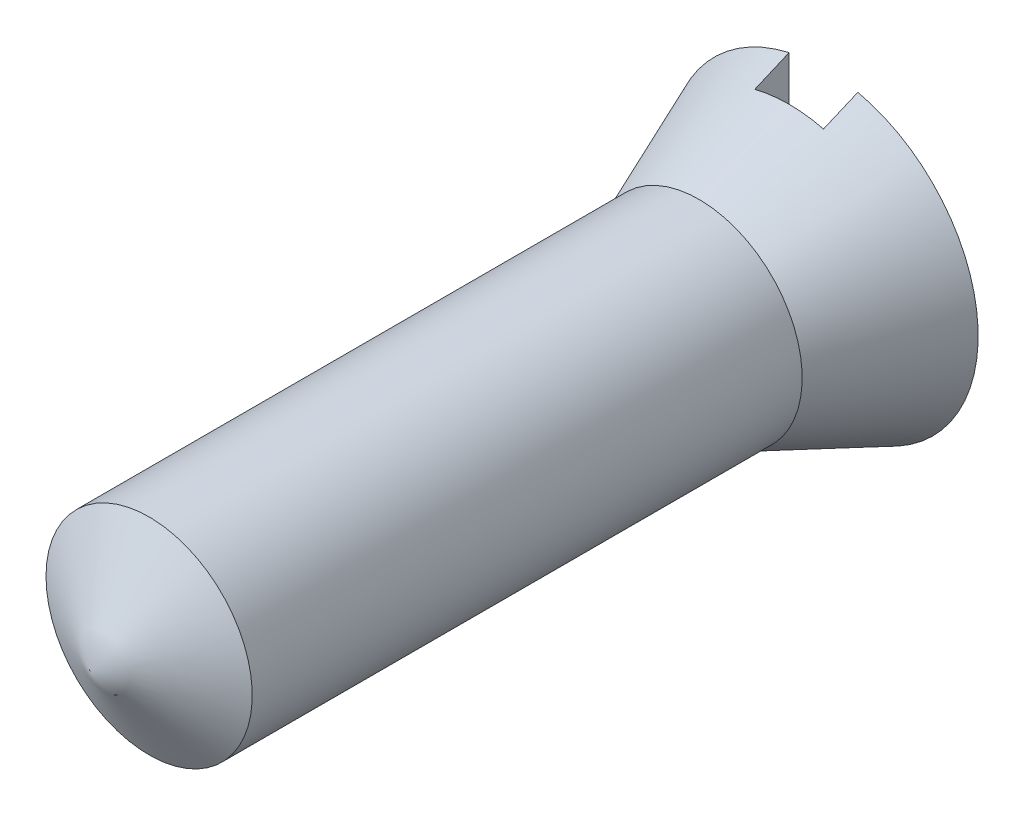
ISO-10303-21;
HEADER;
FILE_DESCRIPTION(('STEP AP214'),'2;1');
FILE_NAME('part.step','',(''),(''),'','','');
FILE_SCHEMA(('AUTOMOTIVE_DESIGN { 1 0 10303 214 1 1 1 1 }'));
ENDSEC;
DATA;
#1=APPLICATION_CONTEXT('core data for automotive mechanical design processes');
#2=APPLICATION_PROTOCOL_DEFINITION('international standard','automotive_design',2000,#1);
#3=PRODUCT_CONTEXT('',#1,'mechanical');
#4=PRODUCT('Part','Part','',(#3));
#5=PRODUCT_RELATED_PRODUCT_CATEGORY('part','',(#4));
#6=PRODUCT_DEFINITION_FORMATION('','',#4);
#7=PRODUCT_DEFINITION_CONTEXT('part definition',#1,'design');
#8=PRODUCT_DEFINITION('design','',#6,#7);
#9=PRODUCT_DEFINITION_SHAPE('','',#8);
#10=(LENGTH_UNIT() NAMED_UNIT(*) SI_UNIT(.MILLI.,.METRE.));
#11=(NAMED_UNIT(*) PLANE_ANGLE_UNIT() SI_UNIT($,.RADIAN.));
#12=(NAMED_UNIT(*) SI_UNIT($,.STERADIAN.) SOLID_ANGLE_UNIT());
#13=UNCERTAINTY_MEASURE_WITH_UNIT(LENGTH_MEASURE(1.E-05),#10,'distance_accuracy_value','');
#14=(GEOMETRIC_REPRESENTATION_CONTEXT(3) GLOBAL_UNCERTAINTY_ASSIGNED_CONTEXT((#13)) GLOBAL_UNIT_ASSIGNED_CONTEXT((#10,
#11,#12)) REPRESENTATION_CONTEXT('',''));
#15=CARTESIAN_POINT('',(0.,0.,0.));
#16=DIRECTION('',(0.,0.,1.));
#17=DIRECTION('',(1.,0.,0.));
#18=AXIS2_PLACEMENT_3D('',#15,#16,#17);
#19=CARTESIAN_POINT('',(0.,0.,-21.3520508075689));
#20=DIRECTION('',(0.,0.,1.));
#21=DIRECTION('',(1.,0.,0.));
#22=AXIS2_PLACEMENT_3D('',#19,#20,#21);
#23=PLANE('',#22);
#24=CARTESIAN_POINT('',(0.,0.,-21.3520508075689));
#25=DIRECTION('',(0.,0.,-1.));
#26=DIRECTION('',(-1.,0.,0.));
#27=AXIS2_PLACEMENT_3D('',#24,#25,#26);
#28=CIRCLE('',#27,4.5);
#29=CARTESIAN_POINT('',(-1.,-4.38748219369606,-21.3520508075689));
#30=VERTEX_POINT('',#29);
#31=CARTESIAN_POINT('',(-1.,4.38748219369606,-21.3520508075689));
#32=VERTEX_POINT('',#31);
#33=EDGE_CURVE('E92',#30,#32,#28,.T.);
#34=ORIENTED_EDGE('',*,*,#33,.T.);
#35=DIRECTION('',(0.,1.,0.));
#36=VECTOR('',#35,1.);
#37=CARTESIAN_POINT('',(-1.,-5.22642009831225,-21.3520508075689));
#38=LINE('',#37,#36);
#39=EDGE_CURVE('E81',#30,#32,#38,.T.);
#40=ORIENTED_EDGE('',*,*,#39,.F.);
#41=EDGE_LOOP('',(#34,#40));
#42=FACE_BOUND('',#41,.T.);
#43=ADVANCED_FACE('F32',(#42),#23,.F.);
#44=CARTESIAN_POINT('',(0.,0.,0.));
#45=DIRECTION('',(0.,0.,-1.));
#46=DIRECTION('',(-1.,0.,0.));
#47=AXIS2_PLACEMENT_3D('',#44,#45,#46);
#48=CONICAL_SURFACE('',#47,0.,1.0471975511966);
#49=CARTESIAN_POINT('',(0.,0.,-1.73205080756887));
#50=DIRECTION('',(0.,0.,-1.));
#51=DIRECTION('',(-1.,0.,0.));
#52=AXIS2_PLACEMENT_3D('',#49,#50,#51);
#53=CIRCLE('',#52,3.);
#54=CARTESIAN_POINT('',(-3.,0.,-1.73205080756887));
#55=VERTEX_POINT('',#54);
#56=EDGE_CURVE('E104',#55,#55,#53,.T.);
#57=ORIENTED_EDGE('',*,*,#56,.F.);
#58=EDGE_LOOP('',(#57));
#59=FACE_BOUND('',#58,.T.);
#60=CARTESIAN_POINT('',(0.,0.,0.));
#61=VERTEX_POINT('',#60);
#62=VERTEX_LOOP('',#61);
#63=FACE_BOUND('',#62,.T.);
#64=ADVANCED_FACE('F34',(#59,#63),#48,.T.);
#65=CARTESIAN_POINT('',(1.,4.38748219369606,-21.3520508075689));
#66=VERTEX_POINT('',#65);
#67=CARTESIAN_POINT('',(1.,-4.38748219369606,-21.3520508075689));
#68=VERTEX_POINT('',#67);
#69=EDGE_CURVE('E98',#66,#68,#28,.T.);
#70=ORIENTED_EDGE('',*,*,#69,.T.);
#71=DIRECTION('',(0.,-1.,0.));
#72=VECTOR('',#71,1.);
#73=CARTESIAN_POINT('',(1.,-5.22642009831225,-21.3520508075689));
#74=LINE('',#73,#72);
#75=EDGE_CURVE('E93',#66,#68,#74,.T.);
#76=ORIENTED_EDGE('',*,*,#75,.F.);
#77=EDGE_LOOP('',(#70,#76));
#78=FACE_BOUND('',#77,.T.);
#79=ADVANCED_FACE('F138',(#78),#23,.F.);
#80=CARTESIAN_POINT('',(0.,0.,-17.7320508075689));
#81=DIRECTION('',(0.,0.,-1.));
#82=DIRECTION('',(-1.,0.,0.));
#83=AXIS2_PLACEMENT_3D('',#80,#81,#82);
#84=CONICAL_SURFACE('',#83,3.,0.392828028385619);
#85=CARTESIAN_POINT('',(0.,0.,-20.3520508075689));
#86=DIRECTION('',(0.,0.,1.));
#87=DIRECTION('',(1.,0.,0.));
#88=AXIS2_PLACEMENT_3D('',#85,#86,#87);
#89=CIRCLE('',#88,4.08563535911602);
#90=CARTESIAN_POINT('',(1.,3.96136545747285,-20.3520508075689));
#91=VERTEX_POINT('',#90);
#92=CARTESIAN_POINT('',(-1.,3.96136545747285,-20.3520508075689));
#93=VERTEX_POINT('',#92);
#94=EDGE_CURVE('E87',#91,#93,#89,.T.);
#95=ORIENTED_EDGE('',*,*,#94,.T.);
#96=CARTESIAN_POINT('',(-1.,1.59998676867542,-15.0454919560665));
#97=CARTESIAN_POINT('',(-1.,1.64992090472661,-15.147709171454));
#98=CARTESIAN_POINT('',(-1.,1.69934652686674,-15.2501725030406));
#99=CARTESIAN_POINT('',(-1.,1.79736388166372,-15.455494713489));
#100=CARTESIAN_POINT('',(-1.,1.84595563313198,-15.5583535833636));
#101=CARTESIAN_POINT('',(-1.,1.99075177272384,-15.8673718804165));
#102=CARTESIAN_POINT('',(-1.,2.08598356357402,-16.0739864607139));
#103=CARTESIAN_POINT('',(-1.,2.27470267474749,-16.4879757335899));
#104=CARTESIAN_POINT('',(-1.,2.36819021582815,-16.6953503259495));
#105=CARTESIAN_POINT('',(-1.,2.5539391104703,-17.1106523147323));
#106=CARTESIAN_POINT('',(-1.,2.64620043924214,-17.3185797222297));
#107=CARTESIAN_POINT('',(-1.,2.84917978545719,-17.7787065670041));
#108=CARTESIAN_POINT('',(-1.,2.95968837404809,-18.030998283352));
#109=CARTESIAN_POINT('',(-1.,3.17975954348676,-18.5359913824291));
#110=CARTESIAN_POINT('',(-1.,3.28932213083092,-18.788692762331));
#111=CARTESIAN_POINT('',(-1.,3.61699042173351,-19.5472855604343));
#112=CARTESIAN_POINT('',(-1.,3.83405876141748,-20.0536248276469));
#113=CARTESIAN_POINT('',(-1.,4.24771254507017,-21.022835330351));
#114=CARTESIAN_POINT('',(-1.,4.44443420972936,-21.4856485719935));
#115=CARTESIAN_POINT('',(-1.,4.83695170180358,-22.4116677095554));
#116=CARTESIAN_POINT('',(-1.,5.03274752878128,-22.8748736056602));
#117=CARTESIAN_POINT('',(-1.,5.42365720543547,-23.8014708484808));
#118=CARTESIAN_POINT('',(-1.,5.61877117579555,-24.2648621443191));
#119=CARTESIAN_POINT('',(-1.,6.00851522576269,-25.1918468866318));
#120=CARTESIAN_POINT('',(-1.,6.20314530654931,-25.65544033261));
#121=CARTESIAN_POINT('',(-1.,6.39761456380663,-26.1191010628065));
#122=B_SPLINE_CURVE_WITH_KNOTS('',3,(#96,#97,#98,#99,#100,#101,#102,#103,#104,#105,#106,#107,
#108,#109,#110,#111,#112,#113,#114,#115,#116,#117,#118,#119,#120,#121),.UNSPECIFIED.,.F.,.F.,(4,
2,2,2,2,2,2,2,2,2,2,2,4),(0.,0.341281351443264,0.682554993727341,1.36505740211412,
2.04747283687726,2.72990204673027,3.55619786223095,4.38248799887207,6.03520194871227,
7.54386254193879,9.0525238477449,10.5609030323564,12.0692785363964),.UNSPECIFIED.);
#123=EDGE_CURVE('E11',#93,#32,#122,.T.);
#124=ORIENTED_EDGE('',*,*,#123,.T.);
#125=ORIENTED_EDGE('',*,*,#33,.F.);
#126=CARTESIAN_POINT('',(-1.,-6.39761456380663,-26.1191010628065));
#127=CARTESIAN_POINT('',(-1.,-6.20311671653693,-25.6553725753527));
#128=CARTESIAN_POINT('',(-1.,-6.0084582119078,-25.19171129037));
#129=CARTESIAN_POINT('',(-1.,-5.61866037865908,-24.2645986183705));
#130=CARTESIAN_POINT('',(-1.,-5.4235210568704,-23.8011472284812));
#131=CARTESIAN_POINT('',(-1.,-5.03261386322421,-22.8745576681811));
#132=CARTESIAN_POINT('',(-1.,-4.8368460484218,-22.4114194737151));
#133=CARTESIAN_POINT('',(-1.,-4.44438342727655,-21.485527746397));
#134=CARTESIAN_POINT('',(-1.,-4.24768860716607,-21.0227742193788));
#135=CARTESIAN_POINT('',(-1.,-3.85290316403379,-20.0977831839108));
#136=CARTESIAN_POINT('',(-1.,-3.65481234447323,-19.6355457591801));
#137=CARTESIAN_POINT('',(-1.,-3.35602728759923,-18.9429108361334));
#138=CARTESIAN_POINT('',(-1.,-3.25615934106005,-18.7121570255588));
#139=CARTESIAN_POINT('',(-1.,-3.05569472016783,-18.2509636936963));
#140=CARTESIAN_POINT('',(-1.,-2.95509804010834,-18.0205241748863));
#141=CARTESIAN_POINT('',(-1.,-2.75291650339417,-17.5600411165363));
#142=CARTESIAN_POINT('',(-1.,-2.65133151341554,-17.3299976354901));
#143=CARTESIAN_POINT('',(-1.,-2.4468151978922,-16.8705141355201));
#144=CARTESIAN_POINT('',(-1.,-2.34388390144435,-16.6410741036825));
#145=CARTESIAN_POINT('',(-1.,-2.188003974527,-16.2975684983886));
#146=CARTESIAN_POINT('',(-1.,-2.13579333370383,-16.1831681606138));
#147=CARTESIAN_POINT('',(-1.,-2.03075961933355,-15.9546498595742));
#148=CARTESIAN_POINT('',(-1.,-1.97793655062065,-15.8405318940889));
#149=CARTESIAN_POINT('',(-1.,-1.8715257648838,-15.6126420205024));
#150=CARTESIAN_POINT('',(-1.,-1.81793799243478,-15.4988701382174));
#151=CARTESIAN_POINT('',(-1.,-1.7097669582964,-15.2717972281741));
#152=CARTESIAN_POINT('',(-1.,-1.6551836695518,-15.1584962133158));
#153=CARTESIAN_POINT('',(-1.,-1.59998676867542,-15.0454919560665));
#154=B_SPLINE_CURVE_WITH_KNOTS('',3,(#126,#127,#128,#129,#130,#131,#132,#133,#134,#135,#136,
#137,#138,#139,#140,#141,#142,#143,#144,#145,#146,#147,#148,#149,#150,#151,#152,#153),
.UNSPECIFIED.,.F.,.F.,(4,2,2,2,2,2,2,2,2,2,2,2,2,4),(0.,1.50859615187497,3.01717099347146,
4.52561255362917,6.03407658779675,7.54275741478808,8.29706970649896,9.05138791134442,
9.80580932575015,10.5602144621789,10.9374669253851,11.3147164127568,11.6919933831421,
12.0692806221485),.UNSPECIFIED.);
#155=CARTESIAN_POINT('',(-1.,-3.96136545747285,-20.3520508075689));
#156=VERTEX_POINT('',#155);
#157=EDGE_CURVE('E78',#30,#156,#154,.T.);
#158=ORIENTED_EDGE('',*,*,#157,.T.);
#159=CARTESIAN_POINT('',(1.,-3.96136545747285,-20.3520508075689));
#160=VERTEX_POINT('',#159);
#161=EDGE_CURVE('E102',#156,#160,#89,.T.);
#162=ORIENTED_EDGE('',*,*,#161,.T.);
#163=CARTESIAN_POINT('',(1.,-1.59998676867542,-15.0454919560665));
#164=CARTESIAN_POINT('',(1.,-1.64992090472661,-15.147709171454));
#165=CARTESIAN_POINT('',(1.,-1.69934652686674,-15.2501725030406));
#166=CARTESIAN_POINT('',(1.,-1.79736388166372,-15.455494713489));
#167=CARTESIAN_POINT('',(1.,-1.84595563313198,-15.5583535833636));
#168=CARTESIAN_POINT('',(1.,-1.99075177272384,-15.8673718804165));
#169=CARTESIAN_POINT('',(1.,-2.08598356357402,-16.0739864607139));
#170=CARTESIAN_POINT('',(1.,-2.27470267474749,-16.4879757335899));
#171=CARTESIAN_POINT('',(1.,-2.36819021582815,-16.6953503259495));
#172=CARTESIAN_POINT('',(1.,-2.5539391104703,-17.1106523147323));
#173=CARTESIAN_POINT('',(1.,-2.64620043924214,-17.3185797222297));
#174=CARTESIAN_POINT('',(1.,-2.84917978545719,-17.7787065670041));
#175=CARTESIAN_POINT('',(1.,-2.95968837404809,-18.030998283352));
#176=CARTESIAN_POINT('',(1.,-3.17975954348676,-18.5359913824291));
#177=CARTESIAN_POINT('',(1.,-3.28932213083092,-18.788692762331));
#178=CARTESIAN_POINT('',(1.,-3.61699042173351,-19.5472855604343));
#179=CARTESIAN_POINT('',(1.,-3.83405876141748,-20.0536248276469));
#180=CARTESIAN_POINT('',(1.,-4.24771254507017,-21.022835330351));
#181=CARTESIAN_POINT('',(1.,-4.44443420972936,-21.4856485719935));
#182=CARTESIAN_POINT('',(1.,-4.83695170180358,-22.4116677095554));
#183=CARTESIAN_POINT('',(1.,-5.03274752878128,-22.8748736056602));
#184=CARTESIAN_POINT('',(1.,-5.42365720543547,-23.8014708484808));
#185=CARTESIAN_POINT('',(1.,-5.61877117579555,-24.2648621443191));
#186=CARTESIAN_POINT('',(1.,-6.00851522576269,-25.1918468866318));
#187=CARTESIAN_POINT('',(1.,-6.20314530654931,-25.65544033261));
#188=CARTESIAN_POINT('',(1.,-6.39761456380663,-26.1191010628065));
#189=B_SPLINE_CURVE_WITH_KNOTS('',3,(#163,#164,#165,#166,#167,#168,#169,#170,#171,#172,#173,
#174,#175,#176,#177,#178,#179,#180,#181,#182,#183,#184,#185,#186,#187,#188),.UNSPECIFIED.,.F.,
.F.,(4,2,2,2,2,2,2,2,2,2,2,2,4),(0.,0.341281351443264,0.682554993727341,1.36505740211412,
2.04747283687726,2.72990204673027,3.55619786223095,4.38248799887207,6.03520194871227,
7.54386254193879,9.0525238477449,10.5609030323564,12.0692785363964),.UNSPECIFIED.);
#190=EDGE_CURVE('E88',#160,#68,#189,.T.);
#191=ORIENTED_EDGE('',*,*,#190,.T.);
#192=ORIENTED_EDGE('',*,*,#69,.F.);
#193=CARTESIAN_POINT('',(1.,6.39761456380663,-26.1191010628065));
#194=CARTESIAN_POINT('',(1.,6.20311671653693,-25.6553725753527));
#195=CARTESIAN_POINT('',(1.,6.0084582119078,-25.19171129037));
#196=CARTESIAN_POINT('',(1.,5.61866037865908,-24.2645986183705));
#197=CARTESIAN_POINT('',(1.,5.4235210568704,-23.8011472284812));
#198=CARTESIAN_POINT('',(1.,5.03261386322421,-22.8745576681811));
#199=CARTESIAN_POINT('',(1.,4.8368460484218,-22.4114194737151));
#200=CARTESIAN_POINT('',(1.,4.44438342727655,-21.485527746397));
#201=CARTESIAN_POINT('',(1.,4.24768860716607,-21.0227742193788));
#202=CARTESIAN_POINT('',(1.,3.85290316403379,-20.0977831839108));
#203=CARTESIAN_POINT('',(1.,3.65481234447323,-19.6355457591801));
#204=CARTESIAN_POINT('',(1.,3.35602728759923,-18.9429108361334));
#205=CARTESIAN_POINT('',(1.,3.25615934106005,-18.7121570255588));
#206=CARTESIAN_POINT('',(1.,3.05569472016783,-18.2509636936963));
#207=CARTESIAN_POINT('',(1.,2.95509804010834,-18.0205241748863));
#208=CARTESIAN_POINT('',(1.,2.75291650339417,-17.5600411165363));
#209=CARTESIAN_POINT('',(1.,2.65133151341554,-17.3299976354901));
#210=CARTESIAN_POINT('',(1.,2.4468151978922,-16.8705141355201));
#211=CARTESIAN_POINT('',(1.,2.34388390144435,-16.6410741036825));
#212=CARTESIAN_POINT('',(1.,2.188003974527,-16.2975684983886));
#213=CARTESIAN_POINT('',(1.,2.13579333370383,-16.1831681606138));
#214=CARTESIAN_POINT('',(1.,2.03075961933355,-15.9546498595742));
#215=CARTESIAN_POINT('',(1.,1.97793655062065,-15.8405318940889));
#216=CARTESIAN_POINT('',(1.,1.8715257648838,-15.6126420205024));
#217=CARTESIAN_POINT('',(1.,1.81793799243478,-15.4988701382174));
#218=CARTESIAN_POINT('',(1.,1.70976695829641,-15.2717972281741));
#219=CARTESIAN_POINT('',(1.,1.6551836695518,-15.1584962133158));
#220=CARTESIAN_POINT('',(1.,1.59998676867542,-15.0454919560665));
#221=B_SPLINE_CURVE_WITH_KNOTS('',3,(#193,#194,#195,#196,#197,#198,#199,#200,#201,#202,#203,
#204,#205,#206,#207,#208,#209,#210,#211,#212,#213,#214,#215,#216,#217,#218,#219,#220),
.UNSPECIFIED.,.F.,.F.,(4,2,2,2,2,2,2,2,2,2,2,2,2,4),(0.,1.50859615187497,3.01717099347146,
4.52561255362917,6.03407658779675,7.54275741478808,8.29706970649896,9.05138791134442,
9.80580932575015,10.5602144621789,10.9374669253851,11.3147164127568,11.6919933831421,
12.0692806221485),.UNSPECIFIED.);
#222=EDGE_CURVE('E45',#66,#91,#221,.T.);
#223=ORIENTED_EDGE('',*,*,#222,.T.);
#224=EDGE_LOOP('',(#95,#124,#125,#158,#162,#191,#192,#223));
#225=FACE_BOUND('',#224,.T.);
#226=CARTESIAN_POINT('',(0.,0.,-17.7320508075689));
#227=DIRECTION('',(0.,0.,-1.));
#228=DIRECTION('',(-1.,0.,0.));
#229=AXIS2_PLACEMENT_3D('',#226,#227,#228);
#230=CIRCLE('',#229,3.);
#231=CARTESIAN_POINT('',(-3.,0.,-17.7320508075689));
#232=VERTEX_POINT('',#231);
#233=EDGE_CURVE('E99',#232,#232,#230,.T.);
#234=ORIENTED_EDGE('',*,*,#233,.T.);
#235=EDGE_LOOP('',(#234));
#236=FACE_BOUND('',#235,.T.);
#237=ADVANCED_FACE('F96',(#225,#236),#84,.T.);
#238=CARTESIAN_POINT('',(0.,0.,0.));
#239=DIRECTION('',(0.,0.,-1.));
#240=DIRECTION('',(-1.,0.,0.));
#241=AXIS2_PLACEMENT_3D('',#238,#239,#240);
#242=CYLINDRICAL_SURFACE('',#241,3.);
#243=ORIENTED_EDGE('',*,*,#233,.F.);
#244=EDGE_LOOP('',(#243));
#245=FACE_BOUND('',#244,.T.);
#246=ORIENTED_EDGE('',*,*,#56,.T.);
#247=EDGE_LOOP('',(#246));
#248=FACE_BOUND('',#247,.T.);
#249=ADVANCED_FACE('F144',(#245,#248),#242,.T.);
#250=CARTESIAN_POINT('',(-1.,-5.22642009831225,-20.3520508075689));
#251=DIRECTION('',(-1.,0.,0.));
#252=DIRECTION('',(0.,0.,1.));
#253=AXIS2_PLACEMENT_3D('',#250,#251,#252);
#254=PLANE('',#253);
#255=ORIENTED_EDGE('',*,*,#39,.T.);
#256=ORIENTED_EDGE('',*,*,#123,.F.);
#257=DIRECTION('',(0.,1.,0.));
#258=VECTOR('',#257,1.);
#259=CARTESIAN_POINT('',(-1.,-5.22642009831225,-20.3520508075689));
#260=LINE('',#259,#258);
#261=EDGE_CURVE('E83',#156,#93,#260,.T.);
#262=ORIENTED_EDGE('',*,*,#261,.F.);
#263=ORIENTED_EDGE('',*,*,#157,.F.);
#264=EDGE_LOOP('',(#255,#256,#262,#263));
#265=FACE_BOUND('',#264,.T.);
#266=ADVANCED_FACE('F80',(#265),#254,.F.);
#267=CARTESIAN_POINT('',(1.,-5.22642009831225,-20.3520508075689));
#268=DIRECTION('',(1.,0.,0.));
#269=DIRECTION('',(0.,0.,-1.));
#270=AXIS2_PLACEMENT_3D('',#267,#268,#269);
#271=PLANE('',#270);
#272=DIRECTION('',(0.,-1.,0.));
#273=VECTOR('',#272,1.);
#274=CARTESIAN_POINT('',(1.,-5.22642009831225,-20.3520508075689));
#275=LINE('',#274,#273);
#276=EDGE_CURVE('E52',#91,#160,#275,.T.);
#277=ORIENTED_EDGE('',*,*,#276,.F.);
#278=ORIENTED_EDGE('',*,*,#222,.F.);
#279=ORIENTED_EDGE('',*,*,#75,.T.);
#280=ORIENTED_EDGE('',*,*,#190,.F.);
#281=EDGE_LOOP('',(#277,#278,#279,#280));
#282=FACE_BOUND('',#281,.T.);
#283=ADVANCED_FACE('F119',(#282),#271,.F.);
#284=CARTESIAN_POINT('',(-1.,5.22642009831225,-20.3520508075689));
#285=DIRECTION('',(0.,0.,1.));
#286=DIRECTION('',(1.,0.,0.));
#287=AXIS2_PLACEMENT_3D('',#284,#285,#286);
#288=PLANE('',#287);
#289=ORIENTED_EDGE('',*,*,#276,.T.);
#290=ORIENTED_EDGE('',*,*,#161,.F.);
#291=ORIENTED_EDGE('',*,*,#261,.T.);
#292=ORIENTED_EDGE('',*,*,#94,.F.);
#293=EDGE_LOOP('',(#289,#290,#291,#292));
#294=FACE_BOUND('',#293,.T.);
#295=ADVANCED_FACE('F123',(#294),#288,.F.);
#296=CLOSED_SHELL('',(#43,#64,#79,#237,#249,#266,#283,#295));
#297=MANIFOLD_SOLID_BREP('B2',#296);
#298=ADVANCED_BREP_SHAPE_REPRESENTATION('',(#18,#297),#14);
#299=SHAPE_DEFINITION_REPRESENTATION(#9,#298);
ENDSEC;
END-ISO-10303-21;
